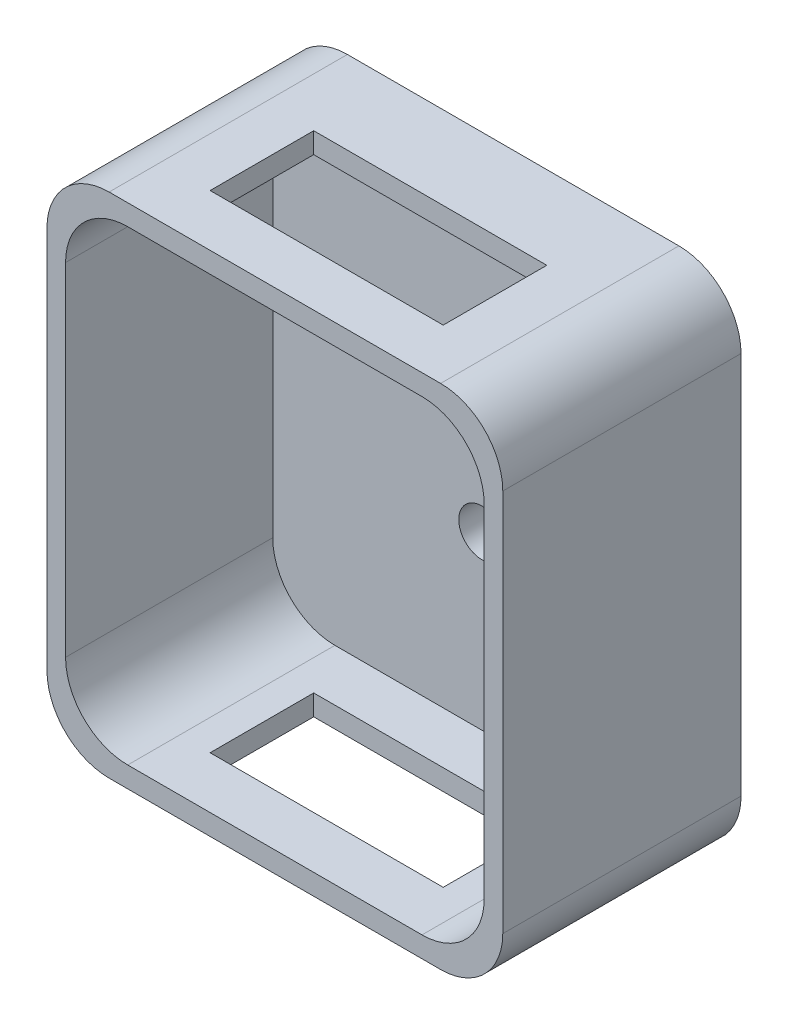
from build123d import *

# Parameters (mm, degrees)
ESQUISSE1_R             = 1.5
ESQUISSE1_R_2           = 2.25
BOSS_EXTRU_1_DEPTH      = 3
BOSS_EXTRU_2_DEPTH      = 20
ESQUISSE3_W             = 22.5
ESQUISSE3_H             = 10
ENL_V_MAT_EXTRU_1_DEPTH = 54


with BuildPart() as part:
    # Esquisse1 → Boss.-Extru.1 (new body)
    with BuildSketch(Plane.XY):
        with BuildLine():
            Line((-16, -24.5), (16, -24.5))
            ThreePointArc((16, -24.5), (20.242640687, -22.742640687), (22, -18.5))
            Line((22, -18.5), (22, 18.5))
            ThreePointArc((22, 18.5), (20.242640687, 22.742640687), (16, 24.5))
            Line((16, 24.5), (-16, 24.5))
            ThreePointArc((-16, 24.5), (-20.242640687, 22.742640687), (-22, 18.5))
            Line((-22, 18.5), (-22, -18.5))
            ThreePointArc((-22, -18.5), (-20.242640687, -22.742640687), (-16, -24.5))
        make_face()
        with Locations((13.4, 12.275)):
            Circle(ESQUISSE1_R, mode=Mode.SUBTRACT)
        with Locations((13.4, -8.225)):
            Circle(ESQUISSE1_R, mode=Mode.SUBTRACT)
        with Locations((0, 6)):
            Circle(ESQUISSE1_R_2, mode=Mode.SUBTRACT)
        with Locations((0, -6)):
            Circle(ESQUISSE1_R_2, mode=Mode.SUBTRACT)
    extrude(amount=BOSS_EXTRU_1_DEPTH)

    # Esquisse2 → Boss.-Extru.2 (add)
    with BuildSketch(Plane.XY.offset(3)):
        with BuildLine():
            Line((-16, -24.5), (16, -24.5))
            ThreePointArc((16, -24.5), (20.242640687, -22.742640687), (22, -18.5))
            Line((22, -18.5), (22, 18.5))
            ThreePointArc((22, 18.5), (20.242640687, 22.742640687), (16, 24.5))
            Line((16, 24.5), (-16, 24.5))
            ThreePointArc((-16, 24.5), (-20.242640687, 22.742640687), (-22, 18.5))
            Line((-22, 18.5), (-22, -18.5))
            ThreePointArc((-22, -18.5), (-20.242640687, -22.742640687), (-16, -24.5))
        make_face()
        with BuildLine():
            Line((-14.204081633, 22.5), (14.204081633, 22.5))
            ThreePointArc((14.204081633, 22.5), (18.44672232, 20.742640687), (20.204081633, 16.5))
            Line((20.204081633, 16.5), (20.204081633, -16.5))
            ThreePointArc((20.204081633, -16.5), (18.44672232, -20.742640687), (14.204081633, -22.5))
            Line((14.204081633, -22.5), (-14.204081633, -22.5))
            ThreePointArc((-14.204081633, -22.5), (-18.44672232, -20.742640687), (-20.204081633, -16.5))
            Line((-20.204081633, -16.5), (-20.204081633, 16.5))
            ThreePointArc((-20.204081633, 16.5), (-18.44672232, 20.742640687), (-14.204081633, 22.5))
        make_face(mode=Mode.SUBTRACT)
    extrude(amount=BOSS_EXTRU_2_DEPTH)

    # Esquisse3 → Enl_v. mat.-Extru.1 (cut)
    with BuildSketch(Plane(origin=(0, 24.5, 0), x_dir=(1, 0, 0), z_dir=(0, 1, 0))):
        with Locations((0, -13)):
            Rectangle(ESQUISSE3_W, ESQUISSE3_H)
    extrude(amount=-ENL_V_MAT_EXTRU_1_DEPTH, mode=Mode.SUBTRACT)


solid = part.part
